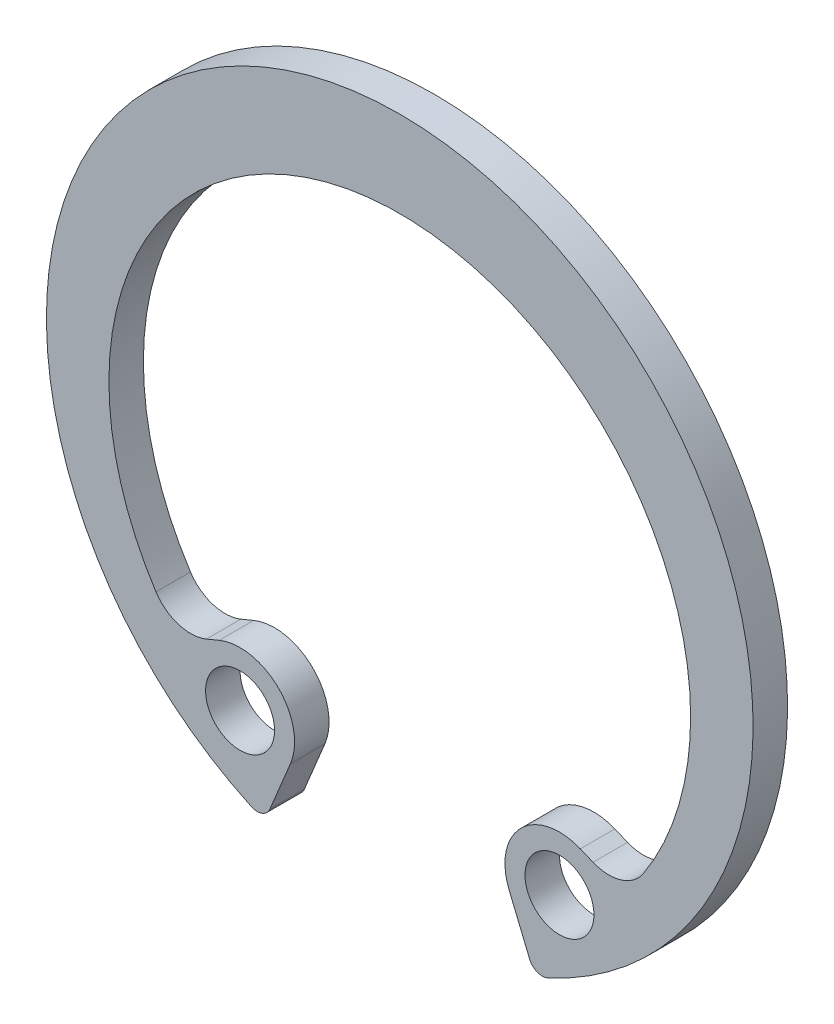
ISO-10303-21;
HEADER;
FILE_DESCRIPTION(('STEP AP214'),'2;1');
FILE_NAME('part.step','',(''),(''),'','','');
FILE_SCHEMA(('AUTOMOTIVE_DESIGN { 1 0 10303 214 1 1 1 1 }'));
ENDSEC;
DATA;
#1=APPLICATION_CONTEXT('core data for automotive mechanical design processes');
#2=APPLICATION_PROTOCOL_DEFINITION('international standard','automotive_design',2000,#1);
#3=PRODUCT_CONTEXT('',#1,'mechanical');
#4=PRODUCT('Part','Part','',(#3));
#5=PRODUCT_RELATED_PRODUCT_CATEGORY('part','',(#4));
#6=PRODUCT_DEFINITION_FORMATION('','',#4);
#7=PRODUCT_DEFINITION_CONTEXT('part definition',#1,'design');
#8=PRODUCT_DEFINITION('design','',#6,#7);
#9=PRODUCT_DEFINITION_SHAPE('','',#8);
#10=(LENGTH_UNIT() NAMED_UNIT(*) SI_UNIT(.MILLI.,.METRE.));
#11=(NAMED_UNIT(*) PLANE_ANGLE_UNIT() SI_UNIT($,.RADIAN.));
#12=(NAMED_UNIT(*) SI_UNIT($,.STERADIAN.) SOLID_ANGLE_UNIT());
#13=UNCERTAINTY_MEASURE_WITH_UNIT(LENGTH_MEASURE(1.E-05),#10,'distance_accuracy_value','');
#14=(GEOMETRIC_REPRESENTATION_CONTEXT(3) GLOBAL_UNCERTAINTY_ASSIGNED_CONTEXT((#13)) GLOBAL_UNIT_ASSIGNED_CONTEXT((#10,
#11,#12)) REPRESENTATION_CONTEXT('',''));
#15=CARTESIAN_POINT('',(0.,0.,0.));
#16=DIRECTION('',(0.,0.,1.));
#17=DIRECTION('',(1.,0.,0.));
#18=AXIS2_PLACEMENT_3D('',#15,#16,#17);
#19=CARTESIAN_POINT('',(-4.63310567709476,-7.05164789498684,1.));
#20=DIRECTION('',(0.,0.,-1.));
#21=DIRECTION('',(-1.,0.,0.));
#22=AXIS2_PLACEMENT_3D('',#19,#20,#21);
#23=CYLINDRICAL_SURFACE('',#22,1.58188268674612);
#24=CARTESIAN_POINT('',(-4.63310567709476,-7.05164789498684,0.));
#25=DIRECTION('',(0.,0.,1.));
#26=DIRECTION('',(1.,0.,0.));
#27=AXIS2_PLACEMENT_3D('',#24,#25,#26);
#28=CIRCLE('',#27,1.58188268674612);
#29=CARTESIAN_POINT('',(-5.23846597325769,-5.59017885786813,0.));
#30=VERTEX_POINT('',#29);
#31=CARTESIAN_POINT('',(-3.17163663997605,-7.65700819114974,0.));
#32=VERTEX_POINT('',#31);
#33=EDGE_CURVE('E134',#30,#32,#28,.F.);
#34=ORIENTED_EDGE('',*,*,#33,.F.);
#35=DIRECTION('',(0.,0.,-1.));
#36=VECTOR('',#35,1.);
#37=CARTESIAN_POINT('',(-5.23846597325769,-5.59017885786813,1.));
#38=LINE('',#37,#36);
#39=CARTESIAN_POINT('',(-5.23846597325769,-5.59017885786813,1.));
#40=VERTEX_POINT('',#39);
#41=EDGE_CURVE('E129',#40,#30,#38,.T.);
#42=ORIENTED_EDGE('',*,*,#41,.F.);
#43=CARTESIAN_POINT('',(-4.63310567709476,-7.05164789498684,1.));
#44=DIRECTION('',(0.,0.,1.));
#45=DIRECTION('',(1.,0.,0.));
#46=AXIS2_PLACEMENT_3D('',#43,#44,#45);
#47=CIRCLE('',#46,1.58188268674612);
#48=CARTESIAN_POINT('',(-3.17163663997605,-7.65700819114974,1.));
#49=VERTEX_POINT('',#48);
#50=EDGE_CURVE('E132',#40,#49,#47,.F.);
#51=ORIENTED_EDGE('',*,*,#50,.T.);
#52=DIRECTION('',(0.,0.,-1.));
#53=VECTOR('',#52,1.);
#54=CARTESIAN_POINT('',(-3.17163663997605,-7.65700819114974,1.));
#55=LINE('',#54,#53);
#56=EDGE_CURVE('E176',#49,#32,#55,.T.);
#57=ORIENTED_EDGE('',*,*,#56,.T.);
#58=EDGE_LOOP('',(#34,#42,#51,#57));
#59=FACE_BOUND('',#58,.T.);
#60=ADVANCED_FACE('F36',(#59),#23,.T.);
#61=CARTESIAN_POINT('',(1.20927110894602,-2.9194387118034,1.));
#62=DIRECTION('',(0.382683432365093,-0.923879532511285,0.));
#63=DIRECTION('',(0.923879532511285,0.382683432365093,0.));
#64=AXIS2_PLACEMENT_3D('',#61,#62,#63);
#65=PLANE('',#64);
#66=DIRECTION('',(-0.923879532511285,-0.382683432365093,0.));
#67=VECTOR('',#66,1.);
#68=CARTESIAN_POINT('',(1.20927110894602,-2.9194387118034,0.));
#69=LINE('',#68,#67);
#70=CARTESIAN_POINT('',(-5.60739828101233,-5.74299562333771,0.));
#71=VERTEX_POINT('',#70);
#72=EDGE_CURVE('E178',#30,#71,#69,.T.);
#73=ORIENTED_EDGE('',*,*,#72,.T.);
#74=DIRECTION('',(0.,0.,1.));
#75=VECTOR('',#74,1.);
#76=CARTESIAN_POINT('',(-5.60739828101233,-5.74299562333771,1.));
#77=LINE('',#76,#75);
#78=CARTESIAN_POINT('',(-5.60739828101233,-5.74299562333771,1.));
#79=VERTEX_POINT('',#78);
#80=EDGE_CURVE('E145',#71,#79,#77,.T.);
#81=ORIENTED_EDGE('',*,*,#80,.T.);
#82=DIRECTION('',(-0.923879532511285,-0.382683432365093,0.));
#83=VECTOR('',#82,1.);
#84=CARTESIAN_POINT('',(1.20927110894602,-2.9194387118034,1.));
#85=LINE('',#84,#83);
#86=EDGE_CURVE('E142',#40,#79,#85,.T.);
#87=ORIENTED_EDGE('',*,*,#86,.F.);
#88=ORIENTED_EDGE('',*,*,#41,.T.);
#89=EDGE_LOOP('',(#73,#81,#87,#88));
#90=FACE_BOUND('',#89,.T.);
#91=ADVANCED_FACE('F143',(#90),#65,.F.);
#92=CARTESIAN_POINT('',(0.,-0.687500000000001,1.));
#93=DIRECTION('',(0.,0.,-1.));
#94=DIRECTION('',(-1.,0.,0.));
#95=AXIS2_PLACEMENT_3D('',#92,#93,#94);
#96=CYLINDRICAL_SURFACE('',#95,8.4375);
#97=CARTESIAN_POINT('',(0.,-0.687500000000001,0.));
#98=DIRECTION('',(0.,0.,1.));
#99=DIRECTION('',(1.,0.,0.));
#100=AXIS2_PLACEMENT_3D('',#97,#98,#99);
#101=CIRCLE('',#100,8.4375);
#102=CARTESIAN_POINT('',(-7.07248259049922,-5.2887385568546,0.));
#103=VERTEX_POINT('',#102);
#104=CARTESIAN_POINT('',(7.07248259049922,-5.2887385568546,0.));
#105=VERTEX_POINT('',#104);
#106=EDGE_CURVE('E180',#103,#105,#101,.F.);
#107=ORIENTED_EDGE('',*,*,#106,.T.);
#108=DIRECTION('',(0.,0.,-1.));
#109=VECTOR('',#108,1.);
#110=CARTESIAN_POINT('',(7.07248259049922,-5.2887385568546,1.));
#111=LINE('',#110,#109);
#112=CARTESIAN_POINT('',(7.07248259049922,-5.2887385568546,1.));
#113=VERTEX_POINT('',#112);
#114=EDGE_CURVE('E208',#105,#113,#111,.F.);
#115=ORIENTED_EDGE('',*,*,#114,.T.);
#116=CARTESIAN_POINT('',(0.,-0.687500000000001,1.));
#117=DIRECTION('',(0.,0.,1.));
#118=DIRECTION('',(1.,0.,0.));
#119=AXIS2_PLACEMENT_3D('',#116,#117,#118);
#120=CIRCLE('',#119,8.4375);
#121=CARTESIAN_POINT('',(-7.07248259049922,-5.2887385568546,1.));
#122=VERTEX_POINT('',#121);
#123=EDGE_CURVE('E147',#122,#113,#120,.F.);
#124=ORIENTED_EDGE('',*,*,#123,.F.);
#125=DIRECTION('',(0.,0.,-1.));
#126=VECTOR('',#125,1.);
#127=CARTESIAN_POINT('',(-7.07248259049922,-5.2887385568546,1.));
#128=LINE('',#127,#126);
#129=EDGE_CURVE('E205',#122,#103,#128,.T.);
#130=ORIENTED_EDGE('',*,*,#129,.T.);
#131=EDGE_LOOP('',(#107,#115,#124,#130));
#132=FACE_BOUND('',#131,.T.);
#133=ADVANCED_FACE('F259',(#132),#96,.F.);
#134=CARTESIAN_POINT('',(-1.20927110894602,-2.9194387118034,1.));
#135=DIRECTION('',(0.382683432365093,0.923879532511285,0.));
#136=DIRECTION('',(-0.923879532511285,0.382683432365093,0.));
#137=AXIS2_PLACEMENT_3D('',#134,#135,#136);
#138=PLANE('',#137);
#139=DIRECTION('',(0.923879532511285,-0.382683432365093,0.));
#140=VECTOR('',#139,1.);
#141=CARTESIAN_POINT('',(-1.20927110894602,-2.9194387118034,1.));
#142=LINE('',#141,#140);
#143=CARTESIAN_POINT('',(5.23846597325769,-5.59017885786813,1.));
#144=VERTEX_POINT('',#143);
#145=CARTESIAN_POINT('',(5.60739828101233,-5.74299562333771,1.));
#146=VERTEX_POINT('',#145);
#147=EDGE_CURVE('E160',#144,#146,#142,.T.);
#148=ORIENTED_EDGE('',*,*,#147,.T.);
#149=DIRECTION('',(0.,0.,-1.));
#150=VECTOR('',#149,1.);
#151=CARTESIAN_POINT('',(5.60739828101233,-5.74299562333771,1.));
#152=LINE('',#151,#150);
#153=CARTESIAN_POINT('',(5.60739828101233,-5.74299562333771,0.));
#154=VERTEX_POINT('',#153);
#155=EDGE_CURVE('E138',#146,#154,#152,.T.);
#156=ORIENTED_EDGE('',*,*,#155,.T.);
#157=DIRECTION('',(0.923879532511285,-0.382683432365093,0.));
#158=VECTOR('',#157,1.);
#159=CARTESIAN_POINT('',(-1.20927110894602,-2.9194387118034,0.));
#160=LINE('',#159,#158);
#161=CARTESIAN_POINT('',(5.23846597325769,-5.59017885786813,0.));
#162=VERTEX_POINT('',#161);
#163=EDGE_CURVE('E183',#162,#154,#160,.T.);
#164=ORIENTED_EDGE('',*,*,#163,.F.);
#165=DIRECTION('',(0.,0.,-1.));
#166=VECTOR('',#165,1.);
#167=CARTESIAN_POINT('',(5.23846597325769,-5.59017885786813,1.));
#168=LINE('',#167,#166);
#169=EDGE_CURVE('E139',#144,#162,#168,.T.);
#170=ORIENTED_EDGE('',*,*,#169,.F.);
#171=EDGE_LOOP('',(#148,#156,#164,#170));
#172=FACE_BOUND('',#171,.T.);
#173=ADVANCED_FACE('F251',(#172),#138,.T.);
#174=CARTESIAN_POINT('',(4.63310567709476,-7.05164789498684,1.));
#175=DIRECTION('',(0.,0.,-1.));
#176=DIRECTION('',(-1.,0.,0.));
#177=AXIS2_PLACEMENT_3D('',#174,#175,#176);
#178=CYLINDRICAL_SURFACE('',#177,1.58188268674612);
#179=CARTESIAN_POINT('',(4.63310567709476,-7.05164789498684,0.));
#180=DIRECTION('',(0.,0.,1.));
#181=DIRECTION('',(1.,0.,0.));
#182=AXIS2_PLACEMENT_3D('',#179,#180,#181);
#183=CIRCLE('',#182,1.58188268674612);
#184=CARTESIAN_POINT('',(3.17163663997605,-7.65700819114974,0.));
#185=VERTEX_POINT('',#184);
#186=EDGE_CURVE('E186',#162,#185,#183,.T.);
#187=ORIENTED_EDGE('',*,*,#186,.T.);
#188=DIRECTION('',(0.,0.,-1.));
#189=VECTOR('',#188,1.);
#190=CARTESIAN_POINT('',(3.17163663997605,-7.65700819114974,1.));
#191=LINE('',#190,#189);
#192=CARTESIAN_POINT('',(3.17163663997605,-7.65700819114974,1.));
#193=VERTEX_POINT('',#192);
#194=EDGE_CURVE('E199',#193,#185,#191,.T.);
#195=ORIENTED_EDGE('',*,*,#194,.F.);
#196=CARTESIAN_POINT('',(4.63310567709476,-7.05164789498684,1.));
#197=DIRECTION('',(0.,0.,1.));
#198=DIRECTION('',(1.,0.,0.));
#199=AXIS2_PLACEMENT_3D('',#196,#197,#198);
#200=CIRCLE('',#199,1.58188268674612);
#201=EDGE_CURVE('E163',#144,#193,#200,.T.);
#202=ORIENTED_EDGE('',*,*,#201,.F.);
#203=ORIENTED_EDGE('',*,*,#169,.T.);
#204=EDGE_LOOP('',(#187,#195,#202,#203));
#205=FACE_BOUND('',#204,.T.);
#206=ADVANCED_FACE('F247',(#205),#178,.T.);
#207=CARTESIAN_POINT('',(0.,0.,1.));
#208=DIRECTION('',(0.923879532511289,0.382683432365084,0.));
#209=DIRECTION('',(-0.382683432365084,0.923879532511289,0.));
#210=AXIS2_PLACEMENT_3D('',#207,#208,#209);
#211=PLANE('',#210);
#212=DIRECTION('',(0.382683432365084,-0.923879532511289,0.));
#213=VECTOR('',#212,1.);
#214=CARTESIAN_POINT('',(0.,0.,0.));
#215=LINE('',#214,#213);
#216=CARTESIAN_POINT('',(3.76632243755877,-9.09270670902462,0.));
#217=VERTEX_POINT('',#216);
#218=EDGE_CURVE('E188',#185,#217,#215,.T.);
#219=ORIENTED_EDGE('',*,*,#218,.T.);
#220=DIRECTION('',(0.,0.,-1.));
#221=VECTOR('',#220,1.);
#222=CARTESIAN_POINT('',(3.76632243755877,-9.09270670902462,1.));
#223=LINE('',#222,#221);
#224=CARTESIAN_POINT('',(3.76632243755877,-9.09270670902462,1.));
#225=VERTEX_POINT('',#224);
#226=EDGE_CURVE('E59',#217,#225,#223,.F.);
#227=ORIENTED_EDGE('',*,*,#226,.T.);
#228=DIRECTION('',(0.382683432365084,-0.923879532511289,0.));
#229=VECTOR('',#228,1.);
#230=CARTESIAN_POINT('',(0.,0.,1.));
#231=LINE('',#230,#229);
#232=EDGE_CURVE('E165',#193,#225,#231,.T.);
#233=ORIENTED_EDGE('',*,*,#232,.F.);
#234=ORIENTED_EDGE('',*,*,#194,.T.);
#235=EDGE_LOOP('',(#219,#227,#233,#234));
#236=FACE_BOUND('',#235,.T.);
#237=ADVANCED_FACE('F243',(#236),#211,.F.);
#238=CARTESIAN_POINT('',(0.,0.,1.));
#239=DIRECTION('',(0.,0.,-1.));
#240=DIRECTION('',(-1.,0.,0.));
#241=AXIS2_PLACEMENT_3D('',#238,#239,#240);
#242=CYLINDRICAL_SURFACE('',#241,10.25);
#243=CARTESIAN_POINT('',(0.,0.,1.));
#244=DIRECTION('',(0.,0.,1.));
#245=DIRECTION('',(1.,0.,0.));
#246=AXIS2_PLACEMENT_3D('',#243,#244,#245);
#247=CIRCLE('',#246,10.25);
#248=CARTESIAN_POINT('',(4.30382853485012,-9.30266413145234,1.));
#249=VERTEX_POINT('',#248);
#250=CARTESIAN_POINT('',(-4.30382853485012,-9.30266413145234,1.));
#251=VERTEX_POINT('',#250);
#252=EDGE_CURVE('E167',#249,#251,#247,.T.);
#253=ORIENTED_EDGE('',*,*,#252,.F.);
#254=DIRECTION('',(0.,0.,-1.));
#255=VECTOR('',#254,1.);
#256=CARTESIAN_POINT('',(4.30382853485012,-9.30266413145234,1.));
#257=LINE('',#256,#255);
#258=CARTESIAN_POINT('',(4.30382853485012,-9.30266413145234,0.));
#259=VERTEX_POINT('',#258);
#260=EDGE_CURVE('E221',#249,#259,#257,.T.);
#261=ORIENTED_EDGE('',*,*,#260,.T.);
#262=CARTESIAN_POINT('',(0.,0.,0.));
#263=DIRECTION('',(0.,0.,1.));
#264=DIRECTION('',(1.,0.,0.));
#265=AXIS2_PLACEMENT_3D('',#262,#263,#264);
#266=CIRCLE('',#265,10.25);
#267=CARTESIAN_POINT('',(-4.30382853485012,-9.30266413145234,0.));
#268=VERTEX_POINT('',#267);
#269=EDGE_CURVE('E190',#259,#268,#266,.T.);
#270=ORIENTED_EDGE('',*,*,#269,.T.);
#271=DIRECTION('',(0.,0.,-1.));
#272=VECTOR('',#271,1.);
#273=CARTESIAN_POINT('',(-4.30382853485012,-9.30266413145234,1.));
#274=LINE('',#273,#272);
#275=EDGE_CURVE('E219',#268,#251,#274,.F.);
#276=ORIENTED_EDGE('',*,*,#275,.T.);
#277=EDGE_LOOP('',(#253,#261,#270,#276));
#278=FACE_BOUND('',#277,.T.);
#279=ADVANCED_FACE('F234',(#278),#242,.T.);
#280=CARTESIAN_POINT('',(4.63310567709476,-7.05164789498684,1.));
#281=DIRECTION('',(0.,0.,-1.));
#282=DIRECTION('',(-1.,0.,0.));
#283=AXIS2_PLACEMENT_3D('',#280,#281,#282);
#284=CYLINDRICAL_SURFACE('',#283,1.);
#285=CARTESIAN_POINT('',(4.63310567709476,-7.05164789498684,1.));
#286=DIRECTION('',(0.,0.,1.));
#287=DIRECTION('',(1.,0.,0.));
#288=AXIS2_PLACEMENT_3D('',#285,#286,#287);
#289=CIRCLE('',#288,1.);
#290=CARTESIAN_POINT('',(5.63310567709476,-7.05164789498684,1.));
#291=VERTEX_POINT('',#290);
#292=EDGE_CURVE('E170',#291,#291,#289,.T.);
#293=ORIENTED_EDGE('',*,*,#292,.T.);
#294=EDGE_LOOP('',(#293));
#295=FACE_BOUND('',#294,.T.);
#296=CARTESIAN_POINT('',(4.63310567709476,-7.05164789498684,0.));
#297=DIRECTION('',(0.,0.,1.));
#298=DIRECTION('',(1.,0.,0.));
#299=AXIS2_PLACEMENT_3D('',#296,#297,#298);
#300=CIRCLE('',#299,1.);
#301=CARTESIAN_POINT('',(5.63310567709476,-7.05164789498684,0.));
#302=VERTEX_POINT('',#301);
#303=EDGE_CURVE('E155',#302,#302,#300,.T.);
#304=ORIENTED_EDGE('',*,*,#303,.F.);
#305=EDGE_LOOP('',(#304));
#306=FACE_BOUND('',#305,.T.);
#307=ADVANCED_FACE('F327',(#295,#306),#284,.F.);
#308=CARTESIAN_POINT('',(0.,0.,1.));
#309=DIRECTION('',(0.923879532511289,-0.382683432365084,0.));
#310=DIRECTION('',(0.382683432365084,0.923879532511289,0.));
#311=AXIS2_PLACEMENT_3D('',#308,#309,#310);
#312=PLANE('',#311);
#313=DIRECTION('',(-0.382683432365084,-0.923879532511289,0.));
#314=VECTOR('',#313,1.);
#315=CARTESIAN_POINT('',(0.,0.,1.));
#316=LINE('',#315,#314);
#317=CARTESIAN_POINT('',(-3.76632243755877,-9.09270670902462,1.));
#318=VERTEX_POINT('',#317);
#319=EDGE_CURVE('E151',#49,#318,#316,.T.);
#320=ORIENTED_EDGE('',*,*,#319,.T.);
#321=DIRECTION('',(0.,0.,1.));
#322=VECTOR('',#321,1.);
#323=CARTESIAN_POINT('',(-3.76632243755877,-9.09270670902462,0.));
#324=LINE('',#323,#322);
#325=CARTESIAN_POINT('',(-3.76632243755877,-9.09270670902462,0.));
#326=VERTEX_POINT('',#325);
#327=EDGE_CURVE('E11',#318,#326,#324,.F.);
#328=ORIENTED_EDGE('',*,*,#327,.T.);
#329=DIRECTION('',(-0.382683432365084,-0.923879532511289,0.));
#330=VECTOR('',#329,1.);
#331=CARTESIAN_POINT('',(0.,0.,0.));
#332=LINE('',#331,#330);
#333=EDGE_CURVE('E193',#32,#326,#332,.T.);
#334=ORIENTED_EDGE('',*,*,#333,.F.);
#335=ORIENTED_EDGE('',*,*,#56,.F.);
#336=EDGE_LOOP('',(#320,#328,#334,#335));
#337=FACE_BOUND('',#336,.T.);
#338=ADVANCED_FACE('F266',(#337),#312,.T.);
#339=CARTESIAN_POINT('',(-4.63310567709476,-7.05164789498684,1.));
#340=DIRECTION('',(0.,0.,-1.));
#341=DIRECTION('',(-1.,0.,0.));
#342=AXIS2_PLACEMENT_3D('',#339,#340,#341);
#343=CYLINDRICAL_SURFACE('',#342,1.);
#344=CARTESIAN_POINT('',(-4.63310567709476,-7.05164789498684,1.));
#345=DIRECTION('',(0.,0.,1.));
#346=DIRECTION('',(1.,0.,0.));
#347=AXIS2_PLACEMENT_3D('',#344,#345,#346);
#348=CIRCLE('',#347,1.);
#349=CARTESIAN_POINT('',(-3.63310567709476,-7.05164789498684,1.));
#350=VERTEX_POINT('',#349);
#351=EDGE_CURVE('E173',#350,#350,#348,.F.);
#352=ORIENTED_EDGE('',*,*,#351,.F.);
#353=EDGE_LOOP('',(#352));
#354=FACE_BOUND('',#353,.T.);
#355=CARTESIAN_POINT('',(-4.63310567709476,-7.05164789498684,0.));
#356=DIRECTION('',(0.,0.,1.));
#357=DIRECTION('',(1.,0.,0.));
#358=AXIS2_PLACEMENT_3D('',#355,#356,#357);
#359=CIRCLE('',#358,1.);
#360=CARTESIAN_POINT('',(-3.63310567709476,-7.05164789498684,0.));
#361=VERTEX_POINT('',#360);
#362=EDGE_CURVE('E152',#361,#361,#359,.F.);
#363=ORIENTED_EDGE('',*,*,#362,.T.);
#364=EDGE_LOOP('',(#363));
#365=FACE_BOUND('',#364,.T.);
#366=ADVANCED_FACE('F316',(#354,#365),#343,.F.);
#367=CARTESIAN_POINT('',(0.,0.,1.));
#368=DIRECTION('',(0.,0.,1.));
#369=DIRECTION('',(1.,0.,0.));
#370=AXIS2_PLACEMENT_3D('',#367,#368,#369);
#371=PLANE('',#370);
#372=ORIENTED_EDGE('',*,*,#232,.T.);
#373=CARTESIAN_POINT('',(4.13587425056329,-8.93963333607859,1.));
#374=DIRECTION('',(0.,0.,1.));
#375=DIRECTION('',(1.,0.,0.));
#376=AXIS2_PLACEMENT_3D('',#373,#374,#375);
#377=CIRCLE('',#376,0.4);
#378=EDGE_CURVE('E44',#225,#249,#377,.T.);
#379=ORIENTED_EDGE('',*,*,#378,.T.);
#380=ORIENTED_EDGE('',*,*,#252,.T.);
#381=CARTESIAN_POINT('',(-4.13587425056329,-8.93963333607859,1.));
#382=DIRECTION('',(0.,0.,1.));
#383=DIRECTION('',(1.,0.,0.));
#384=AXIS2_PLACEMENT_3D('',#381,#382,#383);
#385=CIRCLE('',#384,0.4);
#386=EDGE_CURVE('E51',#251,#318,#385,.T.);
#387=ORIENTED_EDGE('',*,*,#386,.T.);
#388=ORIENTED_EDGE('',*,*,#319,.F.);
#389=ORIENTED_EDGE('',*,*,#50,.F.);
#390=ORIENTED_EDGE('',*,*,#86,.T.);
#391=CARTESIAN_POINT('',(-6.06661839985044,-4.63434018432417,1.));
#392=DIRECTION('',(0.,0.,1.));
#393=DIRECTION('',(1.,0.,0.));
#394=AXIS2_PLACEMENT_3D('',#391,#392,#393);
#395=CIRCLE('',#394,1.2);
#396=EDGE_CURVE('E217',#79,#122,#395,.F.);
#397=ORIENTED_EDGE('',*,*,#396,.T.);
#398=ORIENTED_EDGE('',*,*,#123,.T.);
#399=CARTESIAN_POINT('',(6.06661839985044,-4.63434018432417,1.));
#400=DIRECTION('',(0.,0.,1.));
#401=DIRECTION('',(1.,0.,0.));
#402=AXIS2_PLACEMENT_3D('',#399,#400,#401);
#403=CIRCLE('',#402,1.2);
#404=EDGE_CURVE('E213',#113,#146,#403,.F.);
#405=ORIENTED_EDGE('',*,*,#404,.T.);
#406=ORIENTED_EDGE('',*,*,#147,.F.);
#407=ORIENTED_EDGE('',*,*,#201,.T.);
#408=EDGE_LOOP('',(#372,#379,#380,#387,#388,#389,#390,#397,#398,#405,#406,#407));
#409=FACE_BOUND('',#408,.T.);
#410=ORIENTED_EDGE('',*,*,#292,.F.);
#411=EDGE_LOOP('',(#410));
#412=FACE_BOUND('',#411,.T.);
#413=ORIENTED_EDGE('',*,*,#351,.T.);
#414=EDGE_LOOP('',(#413));
#415=FACE_BOUND('',#414,.T.);
#416=ADVANCED_FACE('F149',(#409,#412,#415),#371,.T.);
#417=CARTESIAN_POINT('',(0.,0.,0.));
#418=DIRECTION('',(0.,0.,1.));
#419=DIRECTION('',(1.,0.,0.));
#420=AXIS2_PLACEMENT_3D('',#417,#418,#419);
#421=PLANE('',#420);
#422=ORIENTED_EDGE('',*,*,#269,.F.);
#423=CARTESIAN_POINT('',(4.13587425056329,-8.93963333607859,0.));
#424=DIRECTION('',(0.,0.,1.));
#425=DIRECTION('',(1.,0.,0.));
#426=AXIS2_PLACEMENT_3D('',#423,#424,#425);
#427=CIRCLE('',#426,0.4);
#428=EDGE_CURVE('E226',#259,#217,#427,.F.);
#429=ORIENTED_EDGE('',*,*,#428,.T.);
#430=ORIENTED_EDGE('',*,*,#218,.F.);
#431=ORIENTED_EDGE('',*,*,#186,.F.);
#432=ORIENTED_EDGE('',*,*,#163,.T.);
#433=CARTESIAN_POINT('',(6.06661839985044,-4.63434018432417,0.));
#434=DIRECTION('',(0.,0.,1.));
#435=DIRECTION('',(1.,0.,0.));
#436=AXIS2_PLACEMENT_3D('',#433,#434,#435);
#437=CIRCLE('',#436,1.2);
#438=EDGE_CURVE('E211',#154,#105,#437,.T.);
#439=ORIENTED_EDGE('',*,*,#438,.T.);
#440=ORIENTED_EDGE('',*,*,#106,.F.);
#441=CARTESIAN_POINT('',(-6.06661839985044,-4.63434018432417,0.));
#442=DIRECTION('',(0.,0.,1.));
#443=DIRECTION('',(1.,0.,0.));
#444=AXIS2_PLACEMENT_3D('',#441,#442,#443);
#445=CIRCLE('',#444,1.2);
#446=EDGE_CURVE('E215',#103,#71,#445,.T.);
#447=ORIENTED_EDGE('',*,*,#446,.T.);
#448=ORIENTED_EDGE('',*,*,#72,.F.);
#449=ORIENTED_EDGE('',*,*,#33,.T.);
#450=ORIENTED_EDGE('',*,*,#333,.T.);
#451=CARTESIAN_POINT('',(-4.13587425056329,-8.93963333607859,0.));
#452=DIRECTION('',(0.,0.,1.));
#453=DIRECTION('',(1.,0.,0.));
#454=AXIS2_PLACEMENT_3D('',#451,#452,#453);
#455=CIRCLE('',#454,0.4);
#456=EDGE_CURVE('E224',#326,#268,#455,.F.);
#457=ORIENTED_EDGE('',*,*,#456,.T.);
#458=EDGE_LOOP('',(#422,#429,#430,#431,#432,#439,#440,#447,#448,#449,#450,#457));
#459=FACE_BOUND('',#458,.T.);
#460=ORIENTED_EDGE('',*,*,#303,.T.);
#461=EDGE_LOOP('',(#460));
#462=FACE_BOUND('',#461,.T.);
#463=ORIENTED_EDGE('',*,*,#362,.F.);
#464=EDGE_LOOP('',(#463));
#465=FACE_BOUND('',#464,.T.);
#466=ADVANCED_FACE('F240',(#459,#462,#465),#421,.F.);
#467=CARTESIAN_POINT('',(6.06661839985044,-4.63434018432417,1.));
#468=DIRECTION('',(0.,0.,-1.));
#469=DIRECTION('',(-1.,0.,0.));
#470=AXIS2_PLACEMENT_3D('',#467,#468,#469);
#471=CYLINDRICAL_SURFACE('',#470,1.2);
#472=ORIENTED_EDGE('',*,*,#404,.F.);
#473=ORIENTED_EDGE('',*,*,#114,.F.);
#474=ORIENTED_EDGE('',*,*,#438,.F.);
#475=ORIENTED_EDGE('',*,*,#155,.F.);
#476=EDGE_LOOP('',(#472,#473,#474,#475));
#477=FACE_BOUND('',#476,.T.);
#478=ADVANCED_FACE('F255',(#477),#471,.F.);
#479=CARTESIAN_POINT('',(-6.06661839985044,-4.63434018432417,1.));
#480=DIRECTION('',(0.,0.,-1.));
#481=DIRECTION('',(-1.,0.,0.));
#482=AXIS2_PLACEMENT_3D('',#479,#480,#481);
#483=CYLINDRICAL_SURFACE('',#482,1.2);
#484=ORIENTED_EDGE('',*,*,#396,.F.);
#485=ORIENTED_EDGE('',*,*,#80,.F.);
#486=ORIENTED_EDGE('',*,*,#446,.F.);
#487=ORIENTED_EDGE('',*,*,#129,.F.);
#488=EDGE_LOOP('',(#484,#485,#486,#487));
#489=FACE_BOUND('',#488,.T.);
#490=ADVANCED_FACE('F263',(#489),#483,.F.);
#491=CARTESIAN_POINT('',(4.13587425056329,-8.93963333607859,1.));
#492=DIRECTION('',(0.,0.,-1.));
#493=DIRECTION('',(-1.,0.,0.));
#494=AXIS2_PLACEMENT_3D('',#491,#492,#493);
#495=CYLINDRICAL_SURFACE('',#494,0.4);
#496=ORIENTED_EDGE('',*,*,#378,.F.);
#497=ORIENTED_EDGE('',*,*,#226,.F.);
#498=ORIENTED_EDGE('',*,*,#428,.F.);
#499=ORIENTED_EDGE('',*,*,#260,.F.);
#500=EDGE_LOOP('',(#496,#497,#498,#499));
#501=FACE_BOUND('',#500,.T.);
#502=ADVANCED_FACE('F237',(#501),#495,.T.);
#503=CARTESIAN_POINT('',(-4.13587425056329,-8.93963333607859,1.));
#504=DIRECTION('',(0.,0.,-1.));
#505=DIRECTION('',(-1.,0.,0.));
#506=AXIS2_PLACEMENT_3D('',#503,#504,#505);
#507=CYLINDRICAL_SURFACE('',#506,0.4);
#508=ORIENTED_EDGE('',*,*,#386,.F.);
#509=ORIENTED_EDGE('',*,*,#275,.F.);
#510=ORIENTED_EDGE('',*,*,#456,.F.);
#511=ORIENTED_EDGE('',*,*,#327,.F.);
#512=EDGE_LOOP('',(#508,#509,#510,#511));
#513=FACE_BOUND('',#512,.T.);
#514=ADVANCED_FACE('F38',(#513),#507,.T.);
#515=CLOSED_SHELL('',(#60,#91,#133,#173,#206,#237,#279,#307,#338,#366,#416,#466,#478,#490,#502,#514));
#516=MANIFOLD_SOLID_BREP('B2',#515);
#517=ADVANCED_BREP_SHAPE_REPRESENTATION('',(#18,#516),#14);
#518=SHAPE_DEFINITION_REPRESENTATION(#9,#517);
ENDSEC;
END-ISO-10303-21;
